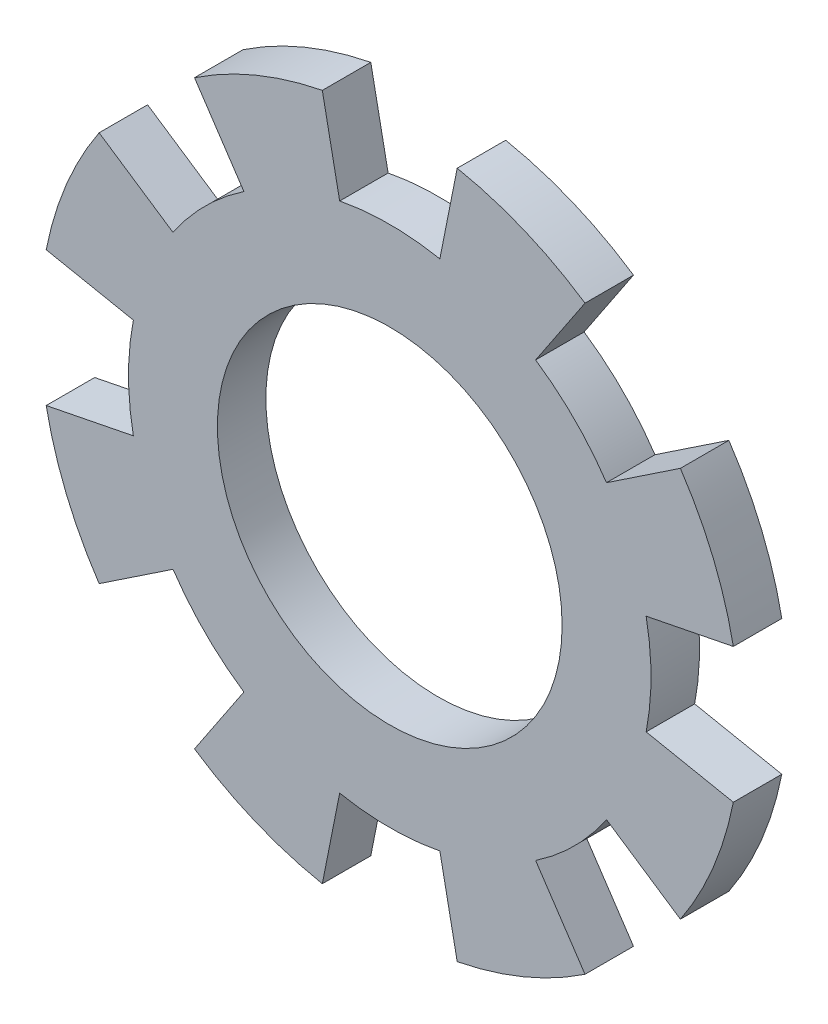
ISO-10303-21;
HEADER;
FILE_DESCRIPTION(('STEP AP214'),'2;1');
FILE_NAME('part.step','',(''),(''),'','','');
FILE_SCHEMA(('AUTOMOTIVE_DESIGN { 1 0 10303 214 1 1 1 1 }'));
ENDSEC;
DATA;
#1=APPLICATION_CONTEXT('core data for automotive mechanical design processes');
#2=APPLICATION_PROTOCOL_DEFINITION('international standard','automotive_design',2000,#1);
#3=PRODUCT_CONTEXT('',#1,'mechanical');
#4=PRODUCT('Part','Part','',(#3));
#5=PRODUCT_RELATED_PRODUCT_CATEGORY('part','',(#4));
#6=PRODUCT_DEFINITION_FORMATION('','',#4);
#7=PRODUCT_DEFINITION_CONTEXT('part definition',#1,'design');
#8=PRODUCT_DEFINITION('design','',#6,#7);
#9=PRODUCT_DEFINITION_SHAPE('','',#8);
#10=(LENGTH_UNIT() NAMED_UNIT(*) SI_UNIT(.MILLI.,.METRE.));
#11=(NAMED_UNIT(*) PLANE_ANGLE_UNIT() SI_UNIT($,.RADIAN.));
#12=(NAMED_UNIT(*) SI_UNIT($,.STERADIAN.) SOLID_ANGLE_UNIT());
#13=UNCERTAINTY_MEASURE_WITH_UNIT(LENGTH_MEASURE(1.E-05),#10,'distance_accuracy_value','');
#14=(GEOMETRIC_REPRESENTATION_CONTEXT(3) GLOBAL_UNCERTAINTY_ASSIGNED_CONTEXT((#13)) GLOBAL_UNIT_ASSIGNED_CONTEXT((#10,
#11,#12)) REPRESENTATION_CONTEXT('',''));
#15=CARTESIAN_POINT('',(0.,0.,0.));
#16=DIRECTION('',(0.,0.,1.));
#17=DIRECTION('',(1.,0.,0.));
#18=AXIS2_PLACEMENT_3D('',#15,#16,#17);
#19=CARTESIAN_POINT('',(0.,0.,0.));
#20=DIRECTION('',(0.,0.,1.));
#21=DIRECTION('',(1.,0.,0.));
#22=AXIS2_PLACEMENT_3D('',#19,#20,#21);
#23=CYLINDRICAL_SURFACE('',#22,3.25);
#24=DIRECTION('',(0.,0.,1.));
#25=VECTOR('',#24,1.);
#26=CARTESIAN_POINT('',(-2.69772917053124,1.81238994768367,0.));
#27=LINE('',#26,#25);
#28=CARTESIAN_POINT('',(-2.69772917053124,1.81238994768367,-0.45));
#29=VERTEX_POINT('',#28);
#30=CARTESIAN_POINT('',(-2.69772917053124,1.81238994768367,0.));
#31=VERTEX_POINT('',#30);
#32=EDGE_CURVE('E274',#29,#31,#27,.T.);
#33=ORIENTED_EDGE('',*,*,#32,.F.);
#34=CARTESIAN_POINT('',(0.,0.,-0.45));
#35=DIRECTION('',(0.,0.,1.));
#36=DIRECTION('',(1.,0.,0.));
#37=AXIS2_PLACEMENT_3D('',#34,#35,#36);
#38=CIRCLE('',#37,3.25);
#39=CARTESIAN_POINT('',(-3.18913581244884,0.626029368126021,-0.45));
#40=VERTEX_POINT('',#39);
#41=EDGE_CURVE('E460',#29,#40,#38,.T.);
#42=ORIENTED_EDGE('',*,*,#41,.T.);
#43=DIRECTION('',(0.,0.,1.));
#44=VECTOR('',#43,1.);
#45=CARTESIAN_POINT('',(-3.18913581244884,0.626029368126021,0.));
#46=LINE('',#45,#44);
#47=CARTESIAN_POINT('',(-3.18913581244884,0.626029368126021,0.));
#48=VERTEX_POINT('',#47);
#49=EDGE_CURVE('E292',#48,#40,#46,.F.);
#50=ORIENTED_EDGE('',*,*,#49,.F.);
#51=CARTESIAN_POINT('',(0.,0.,0.));
#52=DIRECTION('',(0.,0.,1.));
#53=DIRECTION('',(1.,0.,0.));
#54=AXIS2_PLACEMENT_3D('',#51,#52,#53);
#55=CIRCLE('',#54,3.25);
#56=EDGE_CURVE('E456',#31,#48,#55,.T.);
#57=ORIENTED_EDGE('',*,*,#56,.F.);
#58=EDGE_LOOP('',(#33,#42,#50,#57));
#59=FACE_BOUND('',#58,.T.);
#60=ADVANCED_FACE('F35',(#59),#23,.T.);
#61=DIRECTION('',(0.,0.,1.));
#62=VECTOR('',#61,1.);
#63=CARTESIAN_POINT('',(-3.18913581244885,-0.626029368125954,0.));
#64=LINE('',#63,#62);
#65=CARTESIAN_POINT('',(-3.18913581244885,-0.626029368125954,-0.45));
#66=VERTEX_POINT('',#65);
#67=CARTESIAN_POINT('',(-3.18913581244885,-0.626029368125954,0.));
#68=VERTEX_POINT('',#67);
#69=EDGE_CURVE('E296',#66,#68,#64,.T.);
#70=ORIENTED_EDGE('',*,*,#69,.F.);
#71=CARTESIAN_POINT('',(-2.69772917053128,-1.81238994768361,-0.45));
#72=VERTEX_POINT('',#71);
#73=EDGE_CURVE('E493',#66,#72,#38,.T.);
#74=ORIENTED_EDGE('',*,*,#73,.T.);
#75=DIRECTION('',(0.,0.,1.));
#76=VECTOR('',#75,1.);
#77=CARTESIAN_POINT('',(-2.69772917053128,-1.81238994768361,0.));
#78=LINE('',#77,#76);
#79=CARTESIAN_POINT('',(-2.69772917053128,-1.81238994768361,0.));
#80=VERTEX_POINT('',#79);
#81=EDGE_CURVE('E316',#80,#72,#78,.F.);
#82=ORIENTED_EDGE('',*,*,#81,.F.);
#83=EDGE_CURVE('E547',#68,#80,#55,.T.);
#84=ORIENTED_EDGE('',*,*,#83,.F.);
#85=EDGE_LOOP('',(#70,#74,#82,#84));
#86=FACE_BOUND('',#85,.T.);
#87=ADVANCED_FACE('F556',(#86),#23,.T.);
#88=DIRECTION('',(0.,0.,1.));
#89=VECTOR('',#88,1.);
#90=CARTESIAN_POINT('',(-1.81238994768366,-2.69772917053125,0.));
#91=LINE('',#90,#89);
#92=CARTESIAN_POINT('',(-1.81238994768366,-2.69772917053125,-0.45));
#93=VERTEX_POINT('',#92);
#94=CARTESIAN_POINT('',(-1.81238994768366,-2.69772917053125,0.));
#95=VERTEX_POINT('',#94);
#96=EDGE_CURVE('E321',#93,#95,#91,.T.);
#97=ORIENTED_EDGE('',*,*,#96,.F.);
#98=CARTESIAN_POINT('',(-0.62602936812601,-3.18913581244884,-0.45));
#99=VERTEX_POINT('',#98);
#100=EDGE_CURVE('E494',#93,#99,#38,.T.);
#101=ORIENTED_EDGE('',*,*,#100,.T.);
#102=DIRECTION('',(0.,0.,1.));
#103=VECTOR('',#102,1.);
#104=CARTESIAN_POINT('',(-0.62602936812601,-3.18913581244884,0.));
#105=LINE('',#104,#103);
#106=CARTESIAN_POINT('',(-0.62602936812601,-3.18913581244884,0.));
#107=VERTEX_POINT('',#106);
#108=EDGE_CURVE('E341',#107,#99,#105,.F.);
#109=ORIENTED_EDGE('',*,*,#108,.F.);
#110=EDGE_CURVE('E543',#95,#107,#55,.T.);
#111=ORIENTED_EDGE('',*,*,#110,.F.);
#112=EDGE_LOOP('',(#97,#101,#109,#111));
#113=FACE_BOUND('',#112,.T.);
#114=ADVANCED_FACE('F558',(#113),#23,.T.);
#115=DIRECTION('',(0.,0.,1.));
#116=VECTOR('',#115,1.);
#117=CARTESIAN_POINT('',(0.626029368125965,-3.18913581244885,0.));
#118=LINE('',#117,#116);
#119=CARTESIAN_POINT('',(0.626029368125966,-3.18913581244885,-0.45));
#120=VERTEX_POINT('',#119);
#121=CARTESIAN_POINT('',(0.626029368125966,-3.18913581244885,0.));
#122=VERTEX_POINT('',#121);
#123=EDGE_CURVE('E346',#120,#122,#118,.T.);
#124=ORIENTED_EDGE('',*,*,#123,.F.);
#125=CARTESIAN_POINT('',(1.81238994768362,-2.69772917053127,-0.45));
#126=VERTEX_POINT('',#125);
#127=EDGE_CURVE('E498',#120,#126,#38,.T.);
#128=ORIENTED_EDGE('',*,*,#127,.T.);
#129=DIRECTION('',(0.,0.,1.));
#130=VECTOR('',#129,1.);
#131=CARTESIAN_POINT('',(1.81238994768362,-2.69772917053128,0.));
#132=LINE('',#131,#130);
#133=CARTESIAN_POINT('',(1.81238994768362,-2.69772917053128,0.));
#134=VERTEX_POINT('',#133);
#135=EDGE_CURVE('E366',#134,#126,#132,.F.);
#136=ORIENTED_EDGE('',*,*,#135,.F.);
#137=EDGE_CURVE('E539',#122,#134,#55,.T.);
#138=ORIENTED_EDGE('',*,*,#137,.F.);
#139=EDGE_LOOP('',(#124,#128,#136,#138));
#140=FACE_BOUND('',#139,.T.);
#141=ADVANCED_FACE('F564',(#140),#23,.T.);
#142=DIRECTION('',(0.,0.,1.));
#143=VECTOR('',#142,1.);
#144=CARTESIAN_POINT('',(2.69772917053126,-1.81238994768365,0.));
#145=LINE('',#144,#143);
#146=CARTESIAN_POINT('',(2.69772917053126,-1.81238994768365,-0.45));
#147=VERTEX_POINT('',#146);
#148=CARTESIAN_POINT('',(2.69772917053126,-1.81238994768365,0.));
#149=VERTEX_POINT('',#148);
#150=EDGE_CURVE('E371',#147,#149,#145,.T.);
#151=ORIENTED_EDGE('',*,*,#150,.F.);
#152=CARTESIAN_POINT('',(3.18913581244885,-0.626029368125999,-0.45));
#153=VERTEX_POINT('',#152);
#154=EDGE_CURVE('E503',#147,#153,#38,.T.);
#155=ORIENTED_EDGE('',*,*,#154,.T.);
#156=DIRECTION('',(0.,0.,1.));
#157=VECTOR('',#156,1.);
#158=CARTESIAN_POINT('',(3.18913581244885,-0.626029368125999,0.));
#159=LINE('',#158,#157);
#160=CARTESIAN_POINT('',(3.18913581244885,-0.626029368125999,0.));
#161=VERTEX_POINT('',#160);
#162=EDGE_CURVE('E391',#161,#153,#159,.F.);
#163=ORIENTED_EDGE('',*,*,#162,.F.);
#164=EDGE_CURVE('E535',#149,#161,#55,.T.);
#165=ORIENTED_EDGE('',*,*,#164,.F.);
#166=EDGE_LOOP('',(#151,#155,#163,#165));
#167=FACE_BOUND('',#166,.T.);
#168=ADVANCED_FACE('F598',(#167),#23,.T.);
#169=DIRECTION('',(0.,0.,1.));
#170=VECTOR('',#169,1.);
#171=CARTESIAN_POINT('',(3.18913581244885,0.626029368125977,0.));
#172=LINE('',#171,#170);
#173=CARTESIAN_POINT('',(3.18913581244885,0.626029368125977,-0.45));
#174=VERTEX_POINT('',#173);
#175=CARTESIAN_POINT('',(3.18913581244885,0.626029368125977,0.));
#176=VERTEX_POINT('',#175);
#177=EDGE_CURVE('E396',#174,#176,#172,.T.);
#178=ORIENTED_EDGE('',*,*,#177,.F.);
#179=CARTESIAN_POINT('',(2.69772917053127,1.81238994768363,-0.45));
#180=VERTEX_POINT('',#179);
#181=EDGE_CURVE('E508',#174,#180,#38,.T.);
#182=ORIENTED_EDGE('',*,*,#181,.T.);
#183=DIRECTION('',(0.,0.,1.));
#184=VECTOR('',#183,1.);
#185=CARTESIAN_POINT('',(2.69772917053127,1.81238994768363,0.));
#186=LINE('',#185,#184);
#187=CARTESIAN_POINT('',(2.69772917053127,1.81238994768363,0.));
#188=VERTEX_POINT('',#187);
#189=EDGE_CURVE('E416',#188,#180,#186,.F.);
#190=ORIENTED_EDGE('',*,*,#189,.F.);
#191=EDGE_CURVE('E534',#176,#188,#55,.T.);
#192=ORIENTED_EDGE('',*,*,#191,.F.);
#193=EDGE_LOOP('',(#178,#182,#190,#192));
#194=FACE_BOUND('',#193,.T.);
#195=ADVANCED_FACE('F592',(#194),#23,.T.);
#196=DIRECTION('',(0.,0.,1.));
#197=VECTOR('',#196,1.);
#198=CARTESIAN_POINT('',(1.81238994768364,2.69772917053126,0.));
#199=LINE('',#198,#197);
#200=CARTESIAN_POINT('',(1.81238994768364,2.69772917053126,-0.45));
#201=VERTEX_POINT('',#200);
#202=CARTESIAN_POINT('',(1.81238994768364,2.69772917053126,0.));
#203=VERTEX_POINT('',#202);
#204=EDGE_CURVE('E421',#201,#203,#199,.T.);
#205=ORIENTED_EDGE('',*,*,#204,.F.);
#206=CARTESIAN_POINT('',(0.626029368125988,3.18913581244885,-0.45));
#207=VERTEX_POINT('',#206);
#208=EDGE_CURVE('E455',#201,#207,#38,.T.);
#209=ORIENTED_EDGE('',*,*,#208,.T.);
#210=DIRECTION('',(0.,0.,1.));
#211=VECTOR('',#210,1.);
#212=CARTESIAN_POINT('',(0.626029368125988,3.18913581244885,0.));
#213=LINE('',#212,#211);
#214=CARTESIAN_POINT('',(0.626029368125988,3.18913581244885,0.));
#215=VERTEX_POINT('',#214);
#216=EDGE_CURVE('E441',#215,#207,#213,.F.);
#217=ORIENTED_EDGE('',*,*,#216,.F.);
#218=EDGE_CURVE('E451',#203,#215,#55,.T.);
#219=ORIENTED_EDGE('',*,*,#218,.F.);
#220=EDGE_LOOP('',(#205,#209,#217,#219));
#221=FACE_BOUND('',#220,.T.);
#222=ADVANCED_FACE('F521',(#221),#23,.T.);
#223=DIRECTION('',(0.,0.,1.));
#224=VECTOR('',#223,1.);
#225=CARTESIAN_POINT('',(-1.8123899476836,2.69772917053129,0.));
#226=LINE('',#225,#224);
#227=CARTESIAN_POINT('',(-1.8123899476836,2.69772917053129,0.));
#228=VERTEX_POINT('',#227);
#229=CARTESIAN_POINT('',(-1.8123899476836,2.69772917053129,-0.45));
#230=VERTEX_POINT('',#229);
#231=EDGE_CURVE('E258',#228,#230,#226,.F.);
#232=ORIENTED_EDGE('',*,*,#231,.F.);
#233=CARTESIAN_POINT('',(-0.626029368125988,3.18913581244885,0.));
#234=VERTEX_POINT('',#233);
#235=EDGE_CURVE('E452',#234,#228,#55,.T.);
#236=ORIENTED_EDGE('',*,*,#235,.F.);
#237=DIRECTION('',(0.,0.,1.));
#238=VECTOR('',#237,1.);
#239=CARTESIAN_POINT('',(-0.626029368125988,3.18913581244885,0.));
#240=LINE('',#239,#238);
#241=CARTESIAN_POINT('',(-0.626029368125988,3.18913581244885,-0.45));
#242=VERTEX_POINT('',#241);
#243=EDGE_CURVE('E446',#242,#234,#240,.T.);
#244=ORIENTED_EDGE('',*,*,#243,.F.);
#245=EDGE_CURVE('E457',#242,#230,#38,.T.);
#246=ORIENTED_EDGE('',*,*,#245,.T.);
#247=EDGE_LOOP('',(#232,#236,#244,#246));
#248=FACE_BOUND('',#247,.T.);
#249=ADVANCED_FACE('F565',(#248),#23,.T.);
#250=CARTESIAN_POINT('',(0.,0.,0.));
#251=DIRECTION('',(0.,0.,1.));
#252=DIRECTION('',(1.,0.,0.));
#253=AXIS2_PLACEMENT_3D('',#250,#251,#252);
#254=CYLINDRICAL_SURFACE('',#253,1.6);
#255=CARTESIAN_POINT('',(0.,0.,0.));
#256=DIRECTION('',(0.,0.,1.));
#257=DIRECTION('',(1.,0.,0.));
#258=AXIS2_PLACEMENT_3D('',#255,#256,#257);
#259=CIRCLE('',#258,1.6);
#260=CARTESIAN_POINT('',(1.6,0.,0.));
#261=VERTEX_POINT('',#260);
#262=EDGE_CURVE('E448',#261,#261,#259,.T.);
#263=ORIENTED_EDGE('',*,*,#262,.T.);
#264=EDGE_LOOP('',(#263));
#265=FACE_BOUND('',#264,.T.);
#266=CARTESIAN_POINT('',(0.,0.,-0.45));
#267=DIRECTION('',(0.,0.,1.));
#268=DIRECTION('',(1.,0.,0.));
#269=AXIS2_PLACEMENT_3D('',#266,#267,#268);
#270=CIRCLE('',#269,1.6);
#271=CARTESIAN_POINT('',(1.6,0.,-0.45));
#272=VERTEX_POINT('',#271);
#273=EDGE_CURVE('E459',#272,#272,#270,.T.);
#274=ORIENTED_EDGE('',*,*,#273,.F.);
#275=EDGE_LOOP('',(#274));
#276=FACE_BOUND('',#275,.T.);
#277=ADVANCED_FACE('F37',(#265,#276),#254,.F.);
#278=CARTESIAN_POINT('',(1.6,0.,-0.45));
#279=DIRECTION('',(0.,0.,-1.));
#280=DIRECTION('',(-1.,0.,0.));
#281=AXIS2_PLACEMENT_3D('',#278,#279,#280);
#282=PLANE('',#281);
#283=DIRECTION('',(0.831469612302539,-0.555570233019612,0.));
#284=VECTOR('',#283,1.);
#285=CARTESIAN_POINT('',(-2.01176383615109,1.35404256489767,-0.45));
#286=LINE('',#285,#284);
#287=CARTESIAN_POINT('',(-2.01176383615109,1.35404256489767,-0.45));
#288=VERTEX_POINT('',#287);
#289=EDGE_CURVE('E252',#29,#288,#286,.T.);
#290=ORIENTED_EDGE('',*,*,#289,.T.);
#291=CARTESIAN_POINT('',(0.,0.,-0.45));
#292=DIRECTION('',(0.,0.,-1.));
#293=DIRECTION('',(-0.707106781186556,-0.707106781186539,0.));
#294=AXIS2_PLACEMENT_3D('',#291,#292,#293);
#295=CIRCLE('',#294,2.42500000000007);
#296=CARTESIAN_POINT('',(-1.35404256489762,2.01176383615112,-0.45));
#297=VERTEX_POINT('',#296);
#298=EDGE_CURVE('E247',#288,#297,#295,.T.);
#299=ORIENTED_EDGE('',*,*,#298,.T.);
#300=DIRECTION('',(-0.555570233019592,0.831469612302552,0.));
#301=VECTOR('',#300,1.);
#302=CARTESIAN_POINT('',(-1.35404256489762,2.01176383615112,-0.45));
#303=LINE('',#302,#301);
#304=EDGE_CURVE('E255',#297,#230,#303,.T.);
#305=ORIENTED_EDGE('',*,*,#304,.T.);
#306=ORIENTED_EDGE('',*,*,#245,.F.);
#307=DIRECTION('',(0.195090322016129,-0.98078528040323,0.));
#308=VECTOR('',#307,1.);
#309=CARTESIAN_POINT('',(-0.46507917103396,2.37998453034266,-0.45));
#310=LINE('',#309,#308);
#311=CARTESIAN_POINT('',(-0.46507917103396,2.37998453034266,-0.45));
#312=VERTEX_POINT('',#311);
#313=EDGE_CURVE('E431',#242,#312,#310,.T.);
#314=ORIENTED_EDGE('',*,*,#313,.T.);
#315=CARTESIAN_POINT('',(0.,0.,-0.45));
#316=DIRECTION('',(0.,0.,-1.));
#317=DIRECTION('',(-1.,0.,0.));
#318=AXIS2_PLACEMENT_3D('',#315,#316,#317);
#319=CIRCLE('',#318,2.42500000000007);
#320=CARTESIAN_POINT('',(0.46507917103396,2.37998453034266,-0.45));
#321=VERTEX_POINT('',#320);
#322=EDGE_CURVE('E424',#312,#321,#319,.T.);
#323=ORIENTED_EDGE('',*,*,#322,.T.);
#324=DIRECTION('',(0.195090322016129,0.98078528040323,0.));
#325=VECTOR('',#324,1.);
#326=CARTESIAN_POINT('',(0.46507917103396,2.37998453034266,-0.45));
#327=LINE('',#326,#325);
#328=EDGE_CURVE('E427',#321,#207,#327,.T.);
#329=ORIENTED_EDGE('',*,*,#328,.T.);
#330=ORIENTED_EDGE('',*,*,#208,.F.);
#331=DIRECTION('',(-0.555570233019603,-0.831469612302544,0.));
#332=VECTOR('',#331,1.);
#333=CARTESIAN_POINT('',(1.35404256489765,2.0117638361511,-0.45));
#334=LINE('',#333,#332);
#335=CARTESIAN_POINT('',(1.35404256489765,2.0117638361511,-0.45));
#336=VERTEX_POINT('',#335);
#337=EDGE_CURVE('E406',#201,#336,#334,.T.);
#338=ORIENTED_EDGE('',*,*,#337,.T.);
#339=CARTESIAN_POINT('',(0.,0.,-0.45));
#340=DIRECTION('',(0.,0.,-1.));
#341=DIRECTION('',(-0.707106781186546,0.707106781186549,0.));
#342=AXIS2_PLACEMENT_3D('',#339,#340,#341);
#343=CIRCLE('',#342,2.42500000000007);
#344=CARTESIAN_POINT('',(2.01176383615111,1.35404256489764,-0.45));
#345=VERTEX_POINT('',#344);
#346=EDGE_CURVE('E399',#336,#345,#343,.T.);
#347=ORIENTED_EDGE('',*,*,#346,.T.);
#348=DIRECTION('',(0.831469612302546,0.5555702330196,0.));
#349=VECTOR('',#348,1.);
#350=CARTESIAN_POINT('',(2.01176383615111,1.35404256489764,-0.45));
#351=LINE('',#350,#349);
#352=EDGE_CURVE('E402',#345,#180,#351,.T.);
#353=ORIENTED_EDGE('',*,*,#352,.T.);
#354=ORIENTED_EDGE('',*,*,#181,.F.);
#355=DIRECTION('',(-0.980785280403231,-0.195090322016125,0.));
#356=VECTOR('',#355,1.);
#357=CARTESIAN_POINT('',(2.37998453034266,0.465079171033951,-0.45));
#358=LINE('',#357,#356);
#359=CARTESIAN_POINT('',(2.37998453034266,0.465079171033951,-0.45));
#360=VERTEX_POINT('',#359);
#361=EDGE_CURVE('E381',#174,#360,#358,.T.);
#362=ORIENTED_EDGE('',*,*,#361,.T.);
#363=CARTESIAN_POINT('',(0.,0.,-0.45));
#364=DIRECTION('',(0.,0.,-1.));
#365=DIRECTION('',(0.,1.,0.));
#366=AXIS2_PLACEMENT_3D('',#363,#364,#365);
#367=CIRCLE('',#366,2.42500000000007);
#368=CARTESIAN_POINT('',(2.37998453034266,-0.465079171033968,-0.45));
#369=VERTEX_POINT('',#368);
#370=EDGE_CURVE('E374',#360,#369,#367,.T.);
#371=ORIENTED_EDGE('',*,*,#370,.T.);
#372=DIRECTION('',(0.98078528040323,-0.195090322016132,0.));
#373=VECTOR('',#372,1.);
#374=CARTESIAN_POINT('',(2.37998453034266,-0.465079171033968,-0.45));
#375=LINE('',#374,#373);
#376=EDGE_CURVE('E377',#369,#153,#375,.T.);
#377=ORIENTED_EDGE('',*,*,#376,.T.);
#378=ORIENTED_EDGE('',*,*,#154,.F.);
#379=DIRECTION('',(-0.831469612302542,0.555570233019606,0.));
#380=VECTOR('',#379,1.);
#381=CARTESIAN_POINT('',(2.0117638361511,-1.35404256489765,-0.45));
#382=LINE('',#381,#380);
#383=CARTESIAN_POINT('',(2.0117638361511,-1.35404256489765,-0.45));
#384=VERTEX_POINT('',#383);
#385=EDGE_CURVE('E356',#147,#384,#382,.T.);
#386=ORIENTED_EDGE('',*,*,#385,.T.);
#387=CARTESIAN_POINT('',(0.,0.,-0.45));
#388=DIRECTION('',(0.,0.,-1.));
#389=DIRECTION('',(0.707106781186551,0.707106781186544,0.));
#390=AXIS2_PLACEMENT_3D('',#387,#388,#389);
#391=CIRCLE('',#390,2.42500000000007);
#392=CARTESIAN_POINT('',(1.35404256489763,-2.01176383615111,-0.45));
#393=VERTEX_POINT('',#392);
#394=EDGE_CURVE('E349',#384,#393,#391,.T.);
#395=ORIENTED_EDGE('',*,*,#394,.T.);
#396=DIRECTION('',(0.555570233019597,-0.831469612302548,0.));
#397=VECTOR('',#396,1.);
#398=CARTESIAN_POINT('',(1.35404256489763,-2.01176383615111,-0.45));
#399=LINE('',#398,#397);
#400=EDGE_CURVE('E352',#393,#126,#399,.T.);
#401=ORIENTED_EDGE('',*,*,#400,.T.);
#402=ORIENTED_EDGE('',*,*,#127,.F.);
#403=DIRECTION('',(-0.195090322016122,0.980785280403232,0.));
#404=VECTOR('',#403,1.);
#405=CARTESIAN_POINT('',(0.465079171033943,-2.37998453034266,-0.45));
#406=LINE('',#405,#404);
#407=CARTESIAN_POINT('',(0.465079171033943,-2.37998453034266,-0.45));
#408=VERTEX_POINT('',#407);
#409=EDGE_CURVE('E331',#120,#408,#406,.T.);
#410=ORIENTED_EDGE('',*,*,#409,.T.);
#411=CARTESIAN_POINT('',(0.,0.,-0.45));
#412=DIRECTION('',(0.,0.,-1.));
#413=DIRECTION('',(1.,0.,0.));
#414=AXIS2_PLACEMENT_3D('',#411,#412,#413);
#415=CIRCLE('',#414,2.42500000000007);
#416=CARTESIAN_POINT('',(-0.465079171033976,-2.37998453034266,-0.45));
#417=VERTEX_POINT('',#416);
#418=EDGE_CURVE('E324',#408,#417,#415,.T.);
#419=ORIENTED_EDGE('',*,*,#418,.T.);
#420=DIRECTION('',(-0.195090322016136,-0.980785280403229,0.));
#421=VECTOR('',#420,1.);
#422=CARTESIAN_POINT('',(-0.465079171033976,-2.37998453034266,-0.45));
#423=LINE('',#422,#421);
#424=EDGE_CURVE('E327',#417,#99,#423,.T.);
#425=ORIENTED_EDGE('',*,*,#424,.T.);
#426=ORIENTED_EDGE('',*,*,#100,.F.);
#427=DIRECTION('',(0.555570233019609,0.831469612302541,0.));
#428=VECTOR('',#427,1.);
#429=CARTESIAN_POINT('',(-1.35404256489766,-2.01176383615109,-0.45));
#430=LINE('',#429,#428);
#431=CARTESIAN_POINT('',(-1.35404256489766,-2.01176383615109,-0.45));
#432=VERTEX_POINT('',#431);
#433=EDGE_CURVE('E306',#93,#432,#430,.T.);
#434=ORIENTED_EDGE('',*,*,#433,.T.);
#435=CARTESIAN_POINT('',(0.,0.,-0.45));
#436=DIRECTION('',(0.,0.,-1.));
#437=DIRECTION('',(0.707106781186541,-0.707106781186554,0.));
#438=AXIS2_PLACEMENT_3D('',#435,#436,#437);
#439=CIRCLE('',#438,2.42500000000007);
#440=CARTESIAN_POINT('',(-2.01176383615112,-1.35404256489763,-0.45));
#441=VERTEX_POINT('',#440);
#442=EDGE_CURVE('E299',#432,#441,#439,.T.);
#443=ORIENTED_EDGE('',*,*,#442,.T.);
#444=DIRECTION('',(-0.83146961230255,-0.555570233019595,0.));
#445=VECTOR('',#444,1.);
#446=CARTESIAN_POINT('',(-2.01176383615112,-1.35404256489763,-0.45));
#447=LINE('',#446,#445);
#448=EDGE_CURVE('E302',#441,#72,#447,.T.);
#449=ORIENTED_EDGE('',*,*,#448,.T.);
#450=ORIENTED_EDGE('',*,*,#73,.F.);
#451=DIRECTION('',(0.980785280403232,0.195090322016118,0.));
#452=VECTOR('',#451,1.);
#453=CARTESIAN_POINT('',(-2.37998453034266,-0.465079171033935,-0.45));
#454=LINE('',#453,#452);
#455=CARTESIAN_POINT('',(-2.37998453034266,-0.465079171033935,-0.45));
#456=VERTEX_POINT('',#455);
#457=EDGE_CURVE('E283',#66,#456,#454,.T.);
#458=ORIENTED_EDGE('',*,*,#457,.T.);
#459=CARTESIAN_POINT('',(0.,0.,-0.45));
#460=DIRECTION('',(0.,0.,-1.));
#461=DIRECTION('',(0.,-1.,0.));
#462=AXIS2_PLACEMENT_3D('',#459,#460,#461);
#463=CIRCLE('',#462,2.42500000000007);
#464=CARTESIAN_POINT('',(-2.37998453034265,0.465079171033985,-0.45));
#465=VERTEX_POINT('',#464);
#466=EDGE_CURVE('E276',#456,#465,#463,.T.);
#467=ORIENTED_EDGE('',*,*,#466,.T.);
#468=DIRECTION('',(-0.980785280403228,0.195090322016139,0.));
#469=VECTOR('',#468,1.);
#470=CARTESIAN_POINT('',(-2.37998453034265,0.465079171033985,-0.45));
#471=LINE('',#470,#469);
#472=EDGE_CURVE('E279',#465,#40,#471,.T.);
#473=ORIENTED_EDGE('',*,*,#472,.T.);
#474=ORIENTED_EDGE('',*,*,#41,.F.);
#475=EDGE_LOOP('',(#290,#299,#305,#306,#314,#323,#329,#330,#338,#347,#353,#354,#362,#371,#377,
#378,#386,#395,#401,#402,#410,#419,#425,#426,#434,#443,#449,#450,#458,#467,#473,#474));
#476=FACE_BOUND('',#475,.T.);
#477=ORIENTED_EDGE('',*,*,#273,.T.);
#478=EDGE_LOOP('',(#477));
#479=FACE_BOUND('',#478,.T.);
#480=ADVANCED_FACE('F263',(#476,#479),#282,.T.);
#481=CARTESIAN_POINT('',(1.6,0.,0.));
#482=DIRECTION('',(0.,0.,1.));
#483=DIRECTION('',(1.,0.,0.));
#484=AXIS2_PLACEMENT_3D('',#481,#482,#483);
#485=PLANE('',#484);
#486=DIRECTION('',(0.831469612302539,-0.555570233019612,0.));
#487=VECTOR('',#486,1.);
#488=CARTESIAN_POINT('',(1.11068527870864,-0.732311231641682,0.));
#489=LINE('',#488,#487);
#490=CARTESIAN_POINT('',(-2.01176383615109,1.35404256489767,0.));
#491=VERTEX_POINT('',#490);
#492=EDGE_CURVE('E11',#31,#491,#489,.T.);
#493=ORIENTED_EDGE('',*,*,#492,.F.);
#494=ORIENTED_EDGE('',*,*,#56,.T.);
#495=DIRECTION('',(-0.980785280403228,0.195090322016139,0.));
#496=VECTOR('',#495,1.);
#497=CARTESIAN_POINT('',(-2.37998453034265,0.465079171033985,0.));
#498=LINE('',#497,#496);
#499=CARTESIAN_POINT('',(-2.37998453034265,0.465079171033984,0.));
#500=VERTEX_POINT('',#499);
#501=EDGE_CURVE('E280',#500,#48,#498,.T.);
#502=ORIENTED_EDGE('',*,*,#501,.F.);
#503=CARTESIAN_POINT('',(0.,0.,0.));
#504=DIRECTION('',(0.,0.,-1.));
#505=DIRECTION('',(0.,-1.,0.));
#506=AXIS2_PLACEMENT_3D('',#503,#504,#505);
#507=CIRCLE('',#506,2.42500000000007);
#508=CARTESIAN_POINT('',(-2.37998453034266,-0.465079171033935,0.));
#509=VERTEX_POINT('',#508);
#510=EDGE_CURVE('E58',#509,#500,#507,.T.);
#511=ORIENTED_EDGE('',*,*,#510,.F.);
#512=DIRECTION('',(0.980785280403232,0.195090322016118,0.));
#513=VECTOR('',#512,1.);
#514=CARTESIAN_POINT('',(1.53750990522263,0.314158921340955,0.));
#515=LINE('',#514,#513);
#516=EDGE_CURVE('E43',#68,#509,#515,.T.);
#517=ORIENTED_EDGE('',*,*,#516,.F.);
#518=ORIENTED_EDGE('',*,*,#83,.T.);
#519=DIRECTION('',(-0.83146961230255,-0.555570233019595,0.));
#520=VECTOR('',#519,1.);
#521=CARTESIAN_POINT('',(-2.01176383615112,-1.35404256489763,0.));
#522=LINE('',#521,#520);
#523=CARTESIAN_POINT('',(-2.01176383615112,-1.35404256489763,0.));
#524=VERTEX_POINT('',#523);
#525=EDGE_CURVE('E303',#524,#80,#522,.T.);
#526=ORIENTED_EDGE('',*,*,#525,.F.);
#527=CARTESIAN_POINT('',(0.,0.,0.));
#528=DIRECTION('',(0.,0.,-1.));
#529=DIRECTION('',(0.707106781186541,-0.707106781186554,0.));
#530=AXIS2_PLACEMENT_3D('',#527,#528,#529);
#531=CIRCLE('',#530,2.42500000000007);
#532=CARTESIAN_POINT('',(-1.35404256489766,-2.01176383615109,0.));
#533=VERTEX_POINT('',#532);
#534=EDGE_CURVE('E298',#533,#524,#531,.T.);
#535=ORIENTED_EDGE('',*,*,#534,.F.);
#536=DIRECTION('',(0.555570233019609,0.831469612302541,0.));
#537=VECTOR('',#536,1.);
#538=CARTESIAN_POINT('',(0.487060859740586,0.743642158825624,0.));
#539=LINE('',#538,#537);
#540=EDGE_CURVE('E473',#95,#533,#539,.T.);
#541=ORIENTED_EDGE('',*,*,#540,.F.);
#542=ORIENTED_EDGE('',*,*,#110,.T.);
#543=DIRECTION('',(-0.195090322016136,-0.980785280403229,0.));
#544=VECTOR('',#543,1.);
#545=CARTESIAN_POINT('',(-0.465079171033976,-2.37998453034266,0.));
#546=LINE('',#545,#544);
#547=CARTESIAN_POINT('',(-0.465079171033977,-2.37998453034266,0.));
#548=VERTEX_POINT('',#547);
#549=EDGE_CURVE('E328',#548,#107,#546,.T.);
#550=ORIENTED_EDGE('',*,*,#549,.F.);
#551=CARTESIAN_POINT('',(0.,0.,0.));
#552=DIRECTION('',(0.,0.,-1.));
#553=DIRECTION('',(1.,0.,0.));
#554=AXIS2_PLACEMENT_3D('',#551,#552,#553);
#555=CIRCLE('',#554,2.42500000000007);
#556=CARTESIAN_POINT('',(0.465079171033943,-2.37998453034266,0.));
#557=VERTEX_POINT('',#556);
#558=EDGE_CURVE('E323',#557,#548,#555,.T.);
#559=ORIENTED_EDGE('',*,*,#558,.F.);
#560=DIRECTION('',(-0.195090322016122,0.980785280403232,0.));
#561=VECTOR('',#560,1.);
#562=CARTESIAN_POINT('',(0.0528841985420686,-0.307740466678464,0.));
#563=LINE('',#562,#561);
#564=EDGE_CURVE('E471',#122,#557,#563,.T.);
#565=ORIENTED_EDGE('',*,*,#564,.F.);
#566=ORIENTED_EDGE('',*,*,#137,.T.);
#567=DIRECTION('',(0.555570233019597,-0.831469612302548,0.));
#568=VECTOR('',#567,1.);
#569=CARTESIAN_POINT('',(1.35404256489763,-2.01176383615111,0.));
#570=LINE('',#569,#568);
#571=CARTESIAN_POINT('',(1.35404256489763,-2.01176383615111,0.));
#572=VERTEX_POINT('',#571);
#573=EDGE_CURVE('E353',#572,#134,#570,.T.);
#574=ORIENTED_EDGE('',*,*,#573,.F.);
#575=CARTESIAN_POINT('',(0.,0.,0.));
#576=DIRECTION('',(0.,0.,-1.));
#577=DIRECTION('',(0.707106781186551,0.707106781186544,0.));
#578=AXIS2_PLACEMENT_3D('',#575,#576,#577);
#579=CIRCLE('',#578,2.42500000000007);
#580=CARTESIAN_POINT('',(2.0117638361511,-1.35404256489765,0.));
#581=VERTEX_POINT('',#580);
#582=EDGE_CURVE('E348',#581,#572,#579,.T.);
#583=ORIENTED_EDGE('',*,*,#582,.F.);
#584=DIRECTION('',(-0.831469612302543,0.555570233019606,0.));
#585=VECTOR('',#584,1.);
#586=CARTESIAN_POINT('',(1.10160821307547,-0.745896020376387,0.));
#587=LINE('',#586,#585);
#588=EDGE_CURVE('E469',#149,#581,#587,.T.);
#589=ORIENTED_EDGE('',*,*,#588,.F.);
#590=ORIENTED_EDGE('',*,*,#164,.T.);
#591=DIRECTION('',(0.98078528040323,-0.195090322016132,0.));
#592=VECTOR('',#591,1.);
#593=CARTESIAN_POINT('',(2.37998453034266,-0.465079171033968,0.));
#594=LINE('',#593,#592);
#595=CARTESIAN_POINT('',(2.37998453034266,-0.465079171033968,0.));
#596=VERTEX_POINT('',#595);
#597=EDGE_CURVE('E378',#596,#161,#594,.T.);
#598=ORIENTED_EDGE('',*,*,#597,.F.);
#599=CARTESIAN_POINT('',(0.,0.,0.));
#600=DIRECTION('',(0.,0.,-1.));
#601=DIRECTION('',(0.,1.,0.));
#602=AXIS2_PLACEMENT_3D('',#599,#600,#601);
#603=CIRCLE('',#602,2.42500000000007);
#604=CARTESIAN_POINT('',(2.37998453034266,0.465079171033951,0.));
#605=VERTEX_POINT('',#604);
#606=EDGE_CURVE('E373',#605,#596,#603,.T.);
#607=ORIENTED_EDGE('',*,*,#606,.F.);
#608=DIRECTION('',(-0.980785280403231,-0.195090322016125,0.));
#609=VECTOR('',#608,1.);
#610=CARTESIAN_POINT('',(1.54069734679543,0.298134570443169,0.));
#611=LINE('',#610,#609);
#612=EDGE_CURVE('E467',#176,#605,#611,.T.);
#613=ORIENTED_EDGE('',*,*,#612,.F.);
#614=ORIENTED_EDGE('',*,*,#191,.T.);
#615=DIRECTION('',(0.831469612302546,0.5555702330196,0.));
#616=VECTOR('',#615,1.);
#617=CARTESIAN_POINT('',(2.01176383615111,1.35404256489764,0.));
#618=LINE('',#617,#616);
#619=CARTESIAN_POINT('',(2.01176383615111,1.35404256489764,0.));
#620=VERTEX_POINT('',#619);
#621=EDGE_CURVE('E403',#620,#188,#618,.T.);
#622=ORIENTED_EDGE('',*,*,#621,.F.);
#623=CARTESIAN_POINT('',(0.,0.,0.));
#624=DIRECTION('',(0.,0.,-1.));
#625=DIRECTION('',(-0.707106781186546,0.707106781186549,0.));
#626=AXIS2_PLACEMENT_3D('',#623,#624,#625);
#627=CIRCLE('',#626,2.42500000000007);
#628=CARTESIAN_POINT('',(1.35404256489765,2.0117638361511,0.));
#629=VERTEX_POINT('',#628);
#630=EDGE_CURVE('E398',#629,#620,#627,.T.);
#631=ORIENTED_EDGE('',*,*,#630,.F.);
#632=DIRECTION('',(-0.555570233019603,-0.831469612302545,0.));
#633=VECTOR('',#632,1.);
#634=CARTESIAN_POINT('',(0.500645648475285,0.73456509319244,0.));
#635=LINE('',#634,#633);
#636=EDGE_CURVE('E465',#203,#629,#635,.T.);
#637=ORIENTED_EDGE('',*,*,#636,.F.);
#638=ORIENTED_EDGE('',*,*,#218,.T.);
#639=DIRECTION('',(0.195090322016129,0.98078528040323,0.));
#640=VECTOR('',#639,1.);
#641=CARTESIAN_POINT('',(0.46507917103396,2.37998453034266,0.));
#642=LINE('',#641,#640);
#643=CARTESIAN_POINT('',(0.46507917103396,2.37998453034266,0.));
#644=VERTEX_POINT('',#643);
#645=EDGE_CURVE('E428',#644,#215,#642,.T.);
#646=ORIENTED_EDGE('',*,*,#645,.F.);
#647=CARTESIAN_POINT('',(0.,0.,0.));
#648=DIRECTION('',(0.,0.,-1.));
#649=DIRECTION('',(-1.,0.,0.));
#650=AXIS2_PLACEMENT_3D('',#647,#648,#649);
#651=CIRCLE('',#650,2.42500000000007);
#652=CARTESIAN_POINT('',(-0.46507917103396,2.37998453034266,0.));
#653=VERTEX_POINT('',#652);
#654=EDGE_CURVE('E423',#653,#644,#651,.T.);
#655=ORIENTED_EDGE('',*,*,#654,.F.);
#656=DIRECTION('',(0.195090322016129,-0.98078528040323,0.));
#657=VECTOR('',#656,1.);
#658=CARTESIAN_POINT('',(0.0689085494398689,-0.304553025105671,0.));
#659=LINE('',#658,#657);
#660=EDGE_CURVE('E463',#234,#653,#659,.T.);
#661=ORIENTED_EDGE('',*,*,#660,.F.);
#662=ORIENTED_EDGE('',*,*,#235,.T.);
#663=DIRECTION('',(-0.555570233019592,0.831469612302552,0.));
#664=VECTOR('',#663,1.);
#665=CARTESIAN_POINT('',(-1.35404256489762,2.01176383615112,0.));
#666=LINE('',#665,#664);
#667=CARTESIAN_POINT('',(-1.35404256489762,2.01176383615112,0.));
#668=VERTEX_POINT('',#667);
#669=EDGE_CURVE('E266',#668,#228,#666,.T.);
#670=ORIENTED_EDGE('',*,*,#669,.F.);
#671=CARTESIAN_POINT('',(0.,0.,0.));
#672=DIRECTION('',(0.,0.,-1.));
#673=DIRECTION('',(-0.707106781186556,-0.707106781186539,0.));
#674=AXIS2_PLACEMENT_3D('',#671,#672,#673);
#675=CIRCLE('',#674,2.42500000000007);
#676=EDGE_CURVE('E50',#491,#668,#675,.T.);
#677=ORIENTED_EDGE('',*,*,#676,.F.);
#678=EDGE_LOOP('',(#493,#494,#502,#511,#517,#518,#526,#535,#541,#542,#550,#559,#565,#566,#574,
#583,#589,#590,#598,#607,#613,#614,#622,#631,#637,#638,#646,#655,#661,#662,#670,#677));
#679=FACE_BOUND('',#678,.T.);
#680=ORIENTED_EDGE('',*,*,#262,.F.);
#681=EDGE_LOOP('',(#680));
#682=FACE_BOUND('',#681,.T.);
#683=ADVANCED_FACE('F484',(#679,#682),#485,.T.);
#684=CARTESIAN_POINT('',(0.,0.,-0.45));
#685=DIRECTION('',(0.,0.,1.));
#686=DIRECTION('',(1.,0.,0.));
#687=AXIS2_PLACEMENT_3D('',#684,#685,#686);
#688=CYLINDRICAL_SURFACE('',#687,2.42500000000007);
#689=ORIENTED_EDGE('',*,*,#654,.T.);
#690=DIRECTION('',(0.,0.,1.));
#691=VECTOR('',#690,1.);
#692=CARTESIAN_POINT('',(0.46507917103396,2.37998453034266,-0.45));
#693=LINE('',#692,#691);
#694=EDGE_CURVE('E434',#321,#644,#693,.T.);
#695=ORIENTED_EDGE('',*,*,#694,.F.);
#696=ORIENTED_EDGE('',*,*,#322,.F.);
#697=DIRECTION('',(0.,0.,1.));
#698=VECTOR('',#697,1.);
#699=CARTESIAN_POINT('',(-0.46507917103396,2.37998453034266,-0.45));
#700=LINE('',#699,#698);
#701=EDGE_CURVE('E438',#312,#653,#700,.T.);
#702=ORIENTED_EDGE('',*,*,#701,.T.);
#703=EDGE_LOOP('',(#689,#695,#696,#702));
#704=FACE_BOUND('',#703,.T.);
#705=ADVANCED_FACE('F529',(#704),#688,.T.);
#706=CARTESIAN_POINT('',(-0.46507917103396,2.37998453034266,-0.45));
#707=DIRECTION('',(-0.98078528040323,-0.195090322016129,0.));
#708=DIRECTION('',(0.195090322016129,-0.98078528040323,0.));
#709=AXIS2_PLACEMENT_3D('',#706,#707,#708);
#710=PLANE('',#709);
#711=ORIENTED_EDGE('',*,*,#243,.T.);
#712=ORIENTED_EDGE('',*,*,#660,.T.);
#713=ORIENTED_EDGE('',*,*,#701,.F.);
#714=ORIENTED_EDGE('',*,*,#313,.F.);
#715=EDGE_LOOP('',(#711,#712,#713,#714));
#716=FACE_BOUND('',#715,.T.);
#717=ADVANCED_FACE('F633',(#716),#710,.F.);
#718=CARTESIAN_POINT('',(0.46507917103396,2.37998453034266,-0.45));
#719=DIRECTION('',(0.98078528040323,-0.195090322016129,0.));
#720=DIRECTION('',(0.195090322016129,0.98078528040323,0.));
#721=AXIS2_PLACEMENT_3D('',#718,#719,#720);
#722=PLANE('',#721);
#723=ORIENTED_EDGE('',*,*,#216,.T.);
#724=ORIENTED_EDGE('',*,*,#328,.F.);
#725=ORIENTED_EDGE('',*,*,#694,.T.);
#726=ORIENTED_EDGE('',*,*,#645,.T.);
#727=EDGE_LOOP('',(#723,#724,#725,#726));
#728=FACE_BOUND('',#727,.T.);
#729=ADVANCED_FACE('F525',(#728),#722,.F.);
#730=CARTESIAN_POINT('',(0.,0.,-0.45));
#731=DIRECTION('',(0.,0.,1.));
#732=DIRECTION('',(1.,0.,0.));
#733=AXIS2_PLACEMENT_3D('',#730,#731,#732);
#734=CYLINDRICAL_SURFACE('',#733,2.42500000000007);
#735=ORIENTED_EDGE('',*,*,#630,.T.);
#736=DIRECTION('',(0.,0.,1.));
#737=VECTOR('',#736,1.);
#738=CARTESIAN_POINT('',(2.01176383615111,1.35404256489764,-0.45));
#739=LINE('',#738,#737);
#740=EDGE_CURVE('E409',#345,#620,#739,.T.);
#741=ORIENTED_EDGE('',*,*,#740,.F.);
#742=ORIENTED_EDGE('',*,*,#346,.F.);
#743=DIRECTION('',(0.,0.,1.));
#744=VECTOR('',#743,1.);
#745=CARTESIAN_POINT('',(1.35404256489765,2.0117638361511,-0.45));
#746=LINE('',#745,#744);
#747=EDGE_CURVE('E413',#336,#629,#746,.T.);
#748=ORIENTED_EDGE('',*,*,#747,.T.);
#749=EDGE_LOOP('',(#735,#741,#742,#748));
#750=FACE_BOUND('',#749,.T.);
#751=ADVANCED_FACE('F632',(#750),#734,.T.);
#752=CARTESIAN_POINT('',(1.35404256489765,2.0117638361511,-0.45));
#753=DIRECTION('',(-0.831469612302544,0.555570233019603,0.));
#754=DIRECTION('',(-0.555570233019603,-0.831469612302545,0.));
#755=AXIS2_PLACEMENT_3D('',#752,#753,#754);
#756=PLANE('',#755);
#757=ORIENTED_EDGE('',*,*,#204,.T.);
#758=ORIENTED_EDGE('',*,*,#636,.T.);
#759=ORIENTED_EDGE('',*,*,#747,.F.);
#760=ORIENTED_EDGE('',*,*,#337,.F.);
#761=EDGE_LOOP('',(#757,#758,#759,#760));
#762=FACE_BOUND('',#761,.T.);
#763=ADVANCED_FACE('F665',(#762),#756,.F.);
#764=CARTESIAN_POINT('',(2.01176383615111,1.35404256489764,-0.45));
#765=DIRECTION('',(0.5555702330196,-0.831469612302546,0.));
#766=DIRECTION('',(0.831469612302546,0.5555702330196,0.));
#767=AXIS2_PLACEMENT_3D('',#764,#765,#766);
#768=PLANE('',#767);
#769=ORIENTED_EDGE('',*,*,#189,.T.);
#770=ORIENTED_EDGE('',*,*,#352,.F.);
#771=ORIENTED_EDGE('',*,*,#740,.T.);
#772=ORIENTED_EDGE('',*,*,#621,.T.);
#773=EDGE_LOOP('',(#769,#770,#771,#772));
#774=FACE_BOUND('',#773,.T.);
#775=ADVANCED_FACE('F678',(#774),#768,.F.);
#776=CARTESIAN_POINT('',(0.,0.,-0.45));
#777=DIRECTION('',(0.,0.,1.));
#778=DIRECTION('',(1.,0.,0.));
#779=AXIS2_PLACEMENT_3D('',#776,#777,#778);
#780=CYLINDRICAL_SURFACE('',#779,2.42500000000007);
#781=ORIENTED_EDGE('',*,*,#606,.T.);
#782=DIRECTION('',(0.,0.,1.));
#783=VECTOR('',#782,1.);
#784=CARTESIAN_POINT('',(2.37998453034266,-0.465079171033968,-0.45));
#785=LINE('',#784,#783);
#786=EDGE_CURVE('E384',#369,#596,#785,.T.);
#787=ORIENTED_EDGE('',*,*,#786,.F.);
#788=ORIENTED_EDGE('',*,*,#370,.F.);
#789=DIRECTION('',(0.,0.,1.));
#790=VECTOR('',#789,1.);
#791=CARTESIAN_POINT('',(2.37998453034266,0.465079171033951,-0.45));
#792=LINE('',#791,#790);
#793=EDGE_CURVE('E388',#360,#605,#792,.T.);
#794=ORIENTED_EDGE('',*,*,#793,.T.);
#795=EDGE_LOOP('',(#781,#787,#788,#794));
#796=FACE_BOUND('',#795,.T.);
#797=ADVANCED_FACE('F691',(#796),#780,.T.);
#798=CARTESIAN_POINT('',(2.37998453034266,0.465079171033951,-0.45));
#799=DIRECTION('',(-0.195090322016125,0.980785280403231,0.));
#800=DIRECTION('',(-0.980785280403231,-0.195090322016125,0.));
#801=AXIS2_PLACEMENT_3D('',#798,#799,#800);
#802=PLANE('',#801);
#803=ORIENTED_EDGE('',*,*,#177,.T.);
#804=ORIENTED_EDGE('',*,*,#612,.T.);
#805=ORIENTED_EDGE('',*,*,#793,.F.);
#806=ORIENTED_EDGE('',*,*,#361,.F.);
#807=EDGE_LOOP('',(#803,#804,#805,#806));
#808=FACE_BOUND('',#807,.T.);
#809=ADVANCED_FACE('F703',(#808),#802,.F.);
#810=CARTESIAN_POINT('',(2.37998453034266,-0.465079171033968,-0.45));
#811=DIRECTION('',(-0.195090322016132,-0.98078528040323,0.));
#812=DIRECTION('',(0.98078528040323,-0.195090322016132,0.));
#813=AXIS2_PLACEMENT_3D('',#810,#811,#812);
#814=PLANE('',#813);
#815=ORIENTED_EDGE('',*,*,#162,.T.);
#816=ORIENTED_EDGE('',*,*,#376,.F.);
#817=ORIENTED_EDGE('',*,*,#786,.T.);
#818=ORIENTED_EDGE('',*,*,#597,.T.);
#819=EDGE_LOOP('',(#815,#816,#817,#818));
#820=FACE_BOUND('',#819,.T.);
#821=ADVANCED_FACE('F714',(#820),#814,.F.);
#822=CARTESIAN_POINT('',(0.,0.,-0.45));
#823=DIRECTION('',(0.,0.,1.));
#824=DIRECTION('',(1.,0.,0.));
#825=AXIS2_PLACEMENT_3D('',#822,#823,#824);
#826=CYLINDRICAL_SURFACE('',#825,2.42500000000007);
#827=ORIENTED_EDGE('',*,*,#582,.T.);
#828=DIRECTION('',(0.,0.,1.));
#829=VECTOR('',#828,1.);
#830=CARTESIAN_POINT('',(1.35404256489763,-2.01176383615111,-0.45));
#831=LINE('',#830,#829);
#832=EDGE_CURVE('E359',#393,#572,#831,.T.);
#833=ORIENTED_EDGE('',*,*,#832,.F.);
#834=ORIENTED_EDGE('',*,*,#394,.F.);
#835=DIRECTION('',(0.,0.,1.));
#836=VECTOR('',#835,1.);
#837=CARTESIAN_POINT('',(2.0117638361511,-1.35404256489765,-0.45));
#838=LINE('',#837,#836);
#839=EDGE_CURVE('E363',#384,#581,#838,.T.);
#840=ORIENTED_EDGE('',*,*,#839,.T.);
#841=EDGE_LOOP('',(#827,#833,#834,#840));
#842=FACE_BOUND('',#841,.T.);
#843=ADVANCED_FACE('F725',(#842),#826,.T.);
#844=CARTESIAN_POINT('',(2.0117638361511,-1.35404256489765,-0.45));
#845=DIRECTION('',(0.555570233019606,0.831469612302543,0.));
#846=DIRECTION('',(-0.831469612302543,0.555570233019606,0.));
#847=AXIS2_PLACEMENT_3D('',#844,#845,#846);
#848=PLANE('',#847);
#849=ORIENTED_EDGE('',*,*,#150,.T.);
#850=ORIENTED_EDGE('',*,*,#588,.T.);
#851=ORIENTED_EDGE('',*,*,#839,.F.);
#852=ORIENTED_EDGE('',*,*,#385,.F.);
#853=EDGE_LOOP('',(#849,#850,#851,#852));
#854=FACE_BOUND('',#853,.T.);
#855=ADVANCED_FACE('F737',(#854),#848,.F.);
#856=CARTESIAN_POINT('',(1.35404256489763,-2.01176383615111,-0.45));
#857=DIRECTION('',(-0.831469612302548,-0.555570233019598,0.));
#858=DIRECTION('',(0.555570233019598,-0.831469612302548,0.));
#859=AXIS2_PLACEMENT_3D('',#856,#857,#858);
#860=PLANE('',#859);
#861=ORIENTED_EDGE('',*,*,#135,.T.);
#862=ORIENTED_EDGE('',*,*,#400,.F.);
#863=ORIENTED_EDGE('',*,*,#832,.T.);
#864=ORIENTED_EDGE('',*,*,#573,.T.);
#865=EDGE_LOOP('',(#861,#862,#863,#864));
#866=FACE_BOUND('',#865,.T.);
#867=ADVANCED_FACE('F748',(#866),#860,.F.);
#868=CARTESIAN_POINT('',(0.,0.,-0.45));
#869=DIRECTION('',(0.,0.,1.));
#870=DIRECTION('',(1.,0.,0.));
#871=AXIS2_PLACEMENT_3D('',#868,#869,#870);
#872=CYLINDRICAL_SURFACE('',#871,2.42500000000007);
#873=ORIENTED_EDGE('',*,*,#558,.T.);
#874=DIRECTION('',(0.,0.,1.));
#875=VECTOR('',#874,1.);
#876=CARTESIAN_POINT('',(-0.465079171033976,-2.37998453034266,-0.45));
#877=LINE('',#876,#875);
#878=EDGE_CURVE('E334',#417,#548,#877,.T.);
#879=ORIENTED_EDGE('',*,*,#878,.F.);
#880=ORIENTED_EDGE('',*,*,#418,.F.);
#881=DIRECTION('',(0.,0.,1.));
#882=VECTOR('',#881,1.);
#883=CARTESIAN_POINT('',(0.465079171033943,-2.37998453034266,-0.45));
#884=LINE('',#883,#882);
#885=EDGE_CURVE('E338',#408,#557,#884,.T.);
#886=ORIENTED_EDGE('',*,*,#885,.T.);
#887=EDGE_LOOP('',(#873,#879,#880,#886));
#888=FACE_BOUND('',#887,.T.);
#889=ADVANCED_FACE('F759',(#888),#872,.T.);
#890=CARTESIAN_POINT('',(0.465079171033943,-2.37998453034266,-0.45));
#891=DIRECTION('',(0.980785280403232,0.195090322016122,0.));
#892=DIRECTION('',(-0.195090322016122,0.980785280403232,0.));
#893=AXIS2_PLACEMENT_3D('',#890,#891,#892);
#894=PLANE('',#893);
#895=ORIENTED_EDGE('',*,*,#123,.T.);
#896=ORIENTED_EDGE('',*,*,#564,.T.);
#897=ORIENTED_EDGE('',*,*,#885,.F.);
#898=ORIENTED_EDGE('',*,*,#409,.F.);
#899=EDGE_LOOP('',(#895,#896,#897,#898));
#900=FACE_BOUND('',#899,.T.);
#901=ADVANCED_FACE('F770',(#900),#894,.F.);
#902=CARTESIAN_POINT('',(-0.465079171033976,-2.37998453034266,-0.45));
#903=DIRECTION('',(-0.980785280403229,0.195090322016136,0.));
#904=DIRECTION('',(-0.195090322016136,-0.980785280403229,0.));
#905=AXIS2_PLACEMENT_3D('',#902,#903,#904);
#906=PLANE('',#905);
#907=ORIENTED_EDGE('',*,*,#108,.T.);
#908=ORIENTED_EDGE('',*,*,#424,.F.);
#909=ORIENTED_EDGE('',*,*,#878,.T.);
#910=ORIENTED_EDGE('',*,*,#549,.T.);
#911=EDGE_LOOP('',(#907,#908,#909,#910));
#912=FACE_BOUND('',#911,.T.);
#913=ADVANCED_FACE('F781',(#912),#906,.F.);
#914=CARTESIAN_POINT('',(0.,0.,-0.45));
#915=DIRECTION('',(0.,0.,1.));
#916=DIRECTION('',(1.,0.,0.));
#917=AXIS2_PLACEMENT_3D('',#914,#915,#916);
#918=CYLINDRICAL_SURFACE('',#917,2.42500000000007);
#919=ORIENTED_EDGE('',*,*,#534,.T.);
#920=DIRECTION('',(0.,0.,1.));
#921=VECTOR('',#920,1.);
#922=CARTESIAN_POINT('',(-2.01176383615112,-1.35404256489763,-0.45));
#923=LINE('',#922,#921);
#924=EDGE_CURVE('E309',#441,#524,#923,.T.);
#925=ORIENTED_EDGE('',*,*,#924,.F.);
#926=ORIENTED_EDGE('',*,*,#442,.F.);
#927=DIRECTION('',(0.,0.,1.));
#928=VECTOR('',#927,1.);
#929=CARTESIAN_POINT('',(-1.35404256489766,-2.01176383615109,-0.45));
#930=LINE('',#929,#928);
#931=EDGE_CURVE('E313',#432,#533,#930,.T.);
#932=ORIENTED_EDGE('',*,*,#931,.T.);
#933=EDGE_LOOP('',(#919,#925,#926,#932));
#934=FACE_BOUND('',#933,.T.);
#935=ADVANCED_FACE('F792',(#934),#918,.T.);
#936=CARTESIAN_POINT('',(-1.35404256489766,-2.01176383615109,-0.45));
#937=DIRECTION('',(0.831469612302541,-0.555570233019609,0.));
#938=DIRECTION('',(0.555570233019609,0.831469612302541,0.));
#939=AXIS2_PLACEMENT_3D('',#936,#937,#938);
#940=PLANE('',#939);
#941=ORIENTED_EDGE('',*,*,#96,.T.);
#942=ORIENTED_EDGE('',*,*,#540,.T.);
#943=ORIENTED_EDGE('',*,*,#931,.F.);
#944=ORIENTED_EDGE('',*,*,#433,.F.);
#945=EDGE_LOOP('',(#941,#942,#943,#944));
#946=FACE_BOUND('',#945,.T.);
#947=ADVANCED_FACE('F803',(#946),#940,.F.);
#948=CARTESIAN_POINT('',(-2.01176383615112,-1.35404256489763,-0.45));
#949=DIRECTION('',(-0.555570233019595,0.83146961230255,0.));
#950=DIRECTION('',(-0.83146961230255,-0.555570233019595,0.));
#951=AXIS2_PLACEMENT_3D('',#948,#949,#950);
#952=PLANE('',#951);
#953=ORIENTED_EDGE('',*,*,#81,.T.);
#954=ORIENTED_EDGE('',*,*,#448,.F.);
#955=ORIENTED_EDGE('',*,*,#924,.T.);
#956=ORIENTED_EDGE('',*,*,#525,.T.);
#957=EDGE_LOOP('',(#953,#954,#955,#956));
#958=FACE_BOUND('',#957,.T.);
#959=ADVANCED_FACE('F554',(#958),#952,.F.);
#960=CARTESIAN_POINT('',(0.,0.,-0.45));
#961=DIRECTION('',(0.,0.,1.));
#962=DIRECTION('',(1.,0.,0.));
#963=AXIS2_PLACEMENT_3D('',#960,#961,#962);
#964=CYLINDRICAL_SURFACE('',#963,2.42500000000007);
#965=ORIENTED_EDGE('',*,*,#510,.T.);
#966=DIRECTION('',(0.,0.,1.));
#967=VECTOR('',#966,1.);
#968=CARTESIAN_POINT('',(-2.37998453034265,0.465079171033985,-0.45));
#969=LINE('',#968,#967);
#970=EDGE_CURVE('E286',#465,#500,#969,.T.);
#971=ORIENTED_EDGE('',*,*,#970,.F.);
#972=ORIENTED_EDGE('',*,*,#466,.F.);
#973=DIRECTION('',(0.,0.,1.));
#974=VECTOR('',#973,1.);
#975=CARTESIAN_POINT('',(-2.37998453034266,-0.465079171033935,-0.45));
#976=LINE('',#975,#974);
#977=EDGE_CURVE('E290',#456,#509,#976,.T.);
#978=ORIENTED_EDGE('',*,*,#977,.T.);
#979=EDGE_LOOP('',(#965,#971,#972,#978));
#980=FACE_BOUND('',#979,.T.);
#981=ADVANCED_FACE('F481',(#980),#964,.T.);
#982=CARTESIAN_POINT('',(-2.37998453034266,-0.465079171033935,-0.45));
#983=DIRECTION('',(0.195090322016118,-0.980785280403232,0.));
#984=DIRECTION('',(0.980785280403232,0.195090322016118,0.));
#985=AXIS2_PLACEMENT_3D('',#982,#983,#984);
#986=PLANE('',#985);
#987=ORIENTED_EDGE('',*,*,#69,.T.);
#988=ORIENTED_EDGE('',*,*,#516,.T.);
#989=ORIENTED_EDGE('',*,*,#977,.F.);
#990=ORIENTED_EDGE('',*,*,#457,.F.);
#991=EDGE_LOOP('',(#987,#988,#989,#990));
#992=FACE_BOUND('',#991,.T.);
#993=ADVANCED_FACE('F476',(#992),#986,.F.);
#994=CARTESIAN_POINT('',(-2.37998453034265,0.465079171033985,-0.45));
#995=DIRECTION('',(0.195090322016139,0.980785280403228,0.));
#996=DIRECTION('',(-0.980785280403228,0.195090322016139,0.));
#997=AXIS2_PLACEMENT_3D('',#994,#995,#996);
#998=PLANE('',#997);
#999=ORIENTED_EDGE('',*,*,#49,.T.);
#1000=ORIENTED_EDGE('',*,*,#472,.F.);
#1001=ORIENTED_EDGE('',*,*,#970,.T.);
#1002=ORIENTED_EDGE('',*,*,#501,.T.);
#1003=EDGE_LOOP('',(#999,#1000,#1001,#1002));
#1004=FACE_BOUND('',#1003,.T.);
#1005=ADVANCED_FACE('F489',(#1004),#998,.F.);
#1006=CARTESIAN_POINT('',(0.,0.,-0.45));
#1007=DIRECTION('',(0.,0.,1.));
#1008=DIRECTION('',(1.,0.,0.));
#1009=AXIS2_PLACEMENT_3D('',#1006,#1007,#1008);
#1010=CYLINDRICAL_SURFACE('',#1009,2.42500000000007);
#1011=ORIENTED_EDGE('',*,*,#676,.T.);
#1012=DIRECTION('',(0.,0.,1.));
#1013=VECTOR('',#1012,1.);
#1014=CARTESIAN_POINT('',(-1.35404256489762,2.01176383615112,-0.45));
#1015=LINE('',#1014,#1013);
#1016=EDGE_CURVE('E243',#297,#668,#1015,.T.);
#1017=ORIENTED_EDGE('',*,*,#1016,.F.);
#1018=ORIENTED_EDGE('',*,*,#298,.F.);
#1019=DIRECTION('',(0.,0.,1.));
#1020=VECTOR('',#1019,1.);
#1021=CARTESIAN_POINT('',(-2.01176383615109,1.35404256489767,-0.45));
#1022=LINE('',#1021,#1020);
#1023=EDGE_CURVE('E251',#288,#491,#1022,.T.);
#1024=ORIENTED_EDGE('',*,*,#1023,.T.);
#1025=EDGE_LOOP('',(#1011,#1017,#1018,#1024));
#1026=FACE_BOUND('',#1025,.T.);
#1027=ADVANCED_FACE('F245',(#1026),#1010,.T.);
#1028=CARTESIAN_POINT('',(-2.01176383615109,1.35404256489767,-0.45));
#1029=DIRECTION('',(-0.555570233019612,-0.831469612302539,0.));
#1030=DIRECTION('',(0.831469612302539,-0.555570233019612,0.));
#1031=AXIS2_PLACEMENT_3D('',#1028,#1029,#1030);
#1032=PLANE('',#1031);
#1033=ORIENTED_EDGE('',*,*,#32,.T.);
#1034=ORIENTED_EDGE('',*,*,#492,.T.);
#1035=ORIENTED_EDGE('',*,*,#1023,.F.);
#1036=ORIENTED_EDGE('',*,*,#289,.F.);
#1037=EDGE_LOOP('',(#1033,#1034,#1035,#1036));
#1038=FACE_BOUND('',#1037,.T.);
#1039=ADVANCED_FACE('F856',(#1038),#1032,.F.);
#1040=CARTESIAN_POINT('',(-1.35404256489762,2.01176383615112,-0.45));
#1041=DIRECTION('',(0.831469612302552,0.555570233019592,0.));
#1042=DIRECTION('',(-0.555570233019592,0.831469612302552,0.));
#1043=AXIS2_PLACEMENT_3D('',#1040,#1041,#1042);
#1044=PLANE('',#1043);
#1045=ORIENTED_EDGE('',*,*,#231,.T.);
#1046=ORIENTED_EDGE('',*,*,#304,.F.);
#1047=ORIENTED_EDGE('',*,*,#1016,.T.);
#1048=ORIENTED_EDGE('',*,*,#669,.T.);
#1049=EDGE_LOOP('',(#1045,#1046,#1047,#1048));
#1050=FACE_BOUND('',#1049,.T.);
#1051=ADVANCED_FACE('F256',(#1050),#1044,.F.);
#1052=CLOSED_SHELL('',(#60,#87,#114,#141,#168,#195,#222,#249,#277,#480,#683,#705,#717,#729,#751,
#763,#775,#797,#809,#821,#843,#855,#867,#889,#901,#913,#935,#947,#959,#981,#993,#1005,#1027,
#1039,#1051));
#1053=MANIFOLD_SOLID_BREP('B2',#1052);
#1054=ADVANCED_BREP_SHAPE_REPRESENTATION('',(#18,#1053),#14);
#1055=SHAPE_DEFINITION_REPRESENTATION(#9,#1054);
ENDSEC;
END-ISO-10303-21;
